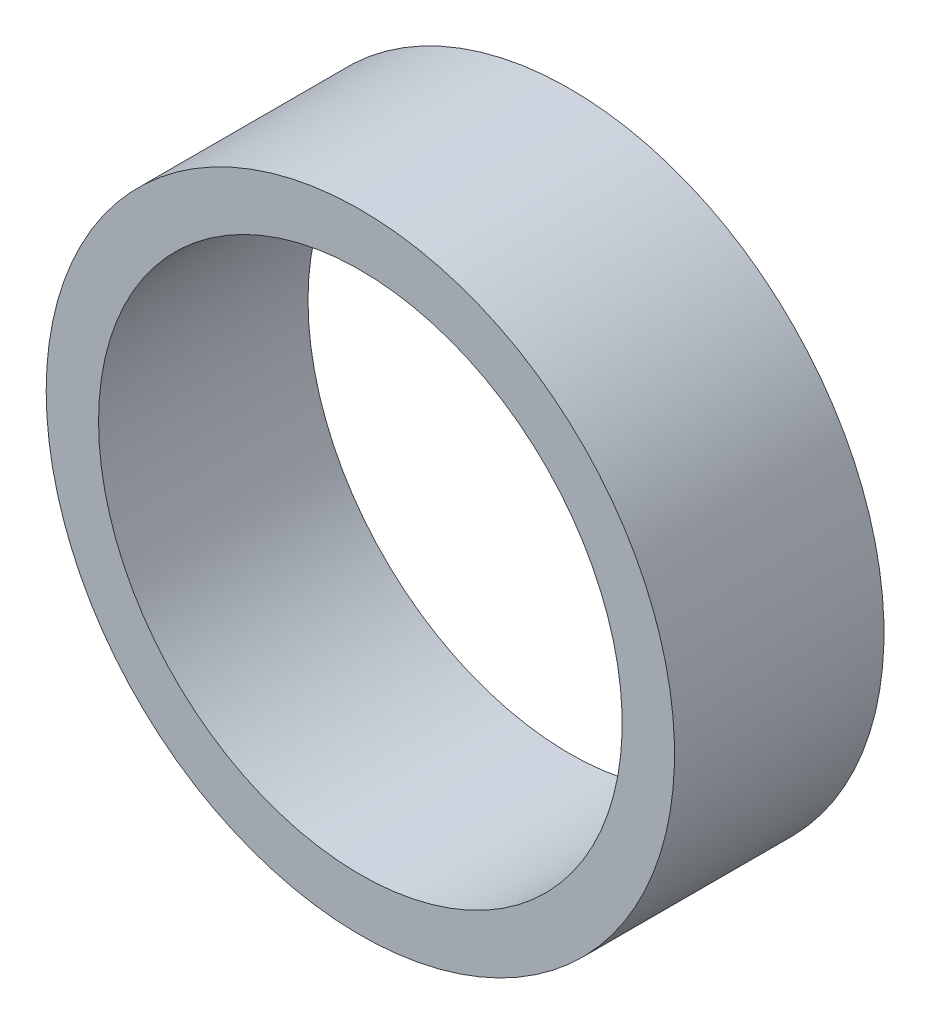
ISO-10303-21;
HEADER;
FILE_DESCRIPTION(('STEP AP214'),'2;1');
FILE_NAME('part.step','',(''),(''),'','','');
FILE_SCHEMA(('AUTOMOTIVE_DESIGN { 1 0 10303 214 1 1 1 1 }'));
ENDSEC;
DATA;
#1=APPLICATION_CONTEXT('core data for automotive mechanical design processes');
#2=APPLICATION_PROTOCOL_DEFINITION('international standard','automotive_design',2000,#1);
#3=PRODUCT_CONTEXT('',#1,'mechanical');
#4=PRODUCT('Part','Part','',(#3));
#5=PRODUCT_RELATED_PRODUCT_CATEGORY('part','',(#4));
#6=PRODUCT_DEFINITION_FORMATION('','',#4);
#7=PRODUCT_DEFINITION_CONTEXT('part definition',#1,'design');
#8=PRODUCT_DEFINITION('design','',#6,#7);
#9=PRODUCT_DEFINITION_SHAPE('','',#8);
#10=(LENGTH_UNIT() NAMED_UNIT(*) SI_UNIT(.MILLI.,.METRE.));
#11=(NAMED_UNIT(*) PLANE_ANGLE_UNIT() SI_UNIT($,.RADIAN.));
#12=(NAMED_UNIT(*) SI_UNIT($,.STERADIAN.) SOLID_ANGLE_UNIT());
#13=UNCERTAINTY_MEASURE_WITH_UNIT(LENGTH_MEASURE(1.E-05),#10,'distance_accuracy_value','');
#14=(GEOMETRIC_REPRESENTATION_CONTEXT(3) GLOBAL_UNCERTAINTY_ASSIGNED_CONTEXT((#13)) GLOBAL_UNIT_ASSIGNED_CONTEXT((#10,
#11,#12)) REPRESENTATION_CONTEXT('',''));
#15=CARTESIAN_POINT('',(0.,0.,0.));
#16=DIRECTION('',(0.,0.,1.));
#17=DIRECTION('',(1.,0.,0.));
#18=AXIS2_PLACEMENT_3D('',#15,#16,#17);
#19=CARTESIAN_POINT('',(0.,0.,-38.9763628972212));
#20=DIRECTION('',(0.,0.,-1.));
#21=DIRECTION('',(-1.,0.,0.));
#22=AXIS2_PLACEMENT_3D('',#19,#20,#21);
#23=CYLINDRICAL_SURFACE('',#22,7.9375);
#24=CARTESIAN_POINT('',(0.,0.,6.35));
#25=DIRECTION('',(0.,0.,-1.));
#26=DIRECTION('',(-1.,0.,0.));
#27=AXIS2_PLACEMENT_3D('',#24,#25,#26);
#28=CIRCLE('',#27,7.9375);
#29=CARTESIAN_POINT('',(-7.9375,0.,6.35));
#30=VERTEX_POINT('',#29);
#31=EDGE_CURVE('E58',#30,#30,#28,.T.);
#32=ORIENTED_EDGE('',*,*,#31,.F.);
#33=EDGE_LOOP('',(#32));
#34=FACE_BOUND('',#33,.T.);
#35=CARTESIAN_POINT('',(0.,0.,0.));
#36=DIRECTION('',(0.,0.,-1.));
#37=DIRECTION('',(-1.,0.,0.));
#38=AXIS2_PLACEMENT_3D('',#35,#36,#37);
#39=CIRCLE('',#38,7.9375);
#40=CARTESIAN_POINT('',(-7.9375,0.,0.));
#41=VERTEX_POINT('',#40);
#42=EDGE_CURVE('E10',#41,#41,#39,.T.);
#43=ORIENTED_EDGE('',*,*,#42,.T.);
#44=EDGE_LOOP('',(#43));
#45=FACE_BOUND('',#44,.T.);
#46=ADVANCED_FACE('F39',(#34,#45),#23,.F.);
#47=CARTESIAN_POINT('',(-9.52500000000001,0.,0.));
#48=DIRECTION('',(0.,0.,1.));
#49=DIRECTION('',(1.,0.,0.));
#50=AXIS2_PLACEMENT_3D('',#47,#48,#49);
#51=PLANE('',#50);
#52=ORIENTED_EDGE('',*,*,#42,.F.);
#53=EDGE_LOOP('',(#52));
#54=FACE_BOUND('',#53,.T.);
#55=CARTESIAN_POINT('',(0.,0.,0.));
#56=DIRECTION('',(0.,0.,-1.));
#57=DIRECTION('',(-1.,0.,0.));
#58=AXIS2_PLACEMENT_3D('',#55,#56,#57);
#59=CIRCLE('',#58,9.525);
#60=CARTESIAN_POINT('',(-9.525,0.,0.));
#61=VERTEX_POINT('',#60);
#62=EDGE_CURVE('E46',#61,#61,#59,.T.);
#63=ORIENTED_EDGE('',*,*,#62,.T.);
#64=EDGE_LOOP('',(#63));
#65=FACE_BOUND('',#64,.T.);
#66=ADVANCED_FACE('F69',(#54,#65),#51,.F.);
#67=CARTESIAN_POINT('',(0.,0.,-38.9763628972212));
#68=DIRECTION('',(0.,0.,-1.));
#69=DIRECTION('',(-1.,0.,0.));
#70=AXIS2_PLACEMENT_3D('',#67,#68,#69);
#71=CYLINDRICAL_SURFACE('',#70,9.525);
#72=ORIENTED_EDGE('',*,*,#62,.F.);
#73=EDGE_LOOP('',(#72));
#74=FACE_BOUND('',#73,.T.);
#75=CARTESIAN_POINT('',(0.,0.,6.35));
#76=DIRECTION('',(0.,0.,-1.));
#77=DIRECTION('',(-1.,0.,0.));
#78=AXIS2_PLACEMENT_3D('',#75,#76,#77);
#79=CIRCLE('',#78,9.525);
#80=CARTESIAN_POINT('',(-9.525,0.,6.35));
#81=VERTEX_POINT('',#80);
#82=EDGE_CURVE('E52',#81,#81,#79,.T.);
#83=ORIENTED_EDGE('',*,*,#82,.T.);
#84=EDGE_LOOP('',(#83));
#85=FACE_BOUND('',#84,.T.);
#86=ADVANCED_FACE('F73',(#74,#85),#71,.T.);
#87=CARTESIAN_POINT('',(-7.93750000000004,0.,6.35));
#88=DIRECTION('',(0.,0.,-1.));
#89=DIRECTION('',(-1.,0.,0.));
#90=AXIS2_PLACEMENT_3D('',#87,#88,#89);
#91=PLANE('',#90);
#92=ORIENTED_EDGE('',*,*,#82,.F.);
#93=EDGE_LOOP('',(#92));
#94=FACE_BOUND('',#93,.T.);
#95=ORIENTED_EDGE('',*,*,#31,.T.);
#96=EDGE_LOOP('',(#95));
#97=FACE_BOUND('',#96,.T.);
#98=ADVANCED_FACE('F66',(#94,#97),#91,.F.);
#99=CLOSED_SHELL('',(#46,#66,#86,#98));
#100=MANIFOLD_SOLID_BREP('B2',#99);
#101=ADVANCED_BREP_SHAPE_REPRESENTATION('',(#18,#100),#14);
#102=SHAPE_DEFINITION_REPRESENTATION(#9,#101);
ENDSEC;
END-ISO-10303-21;
